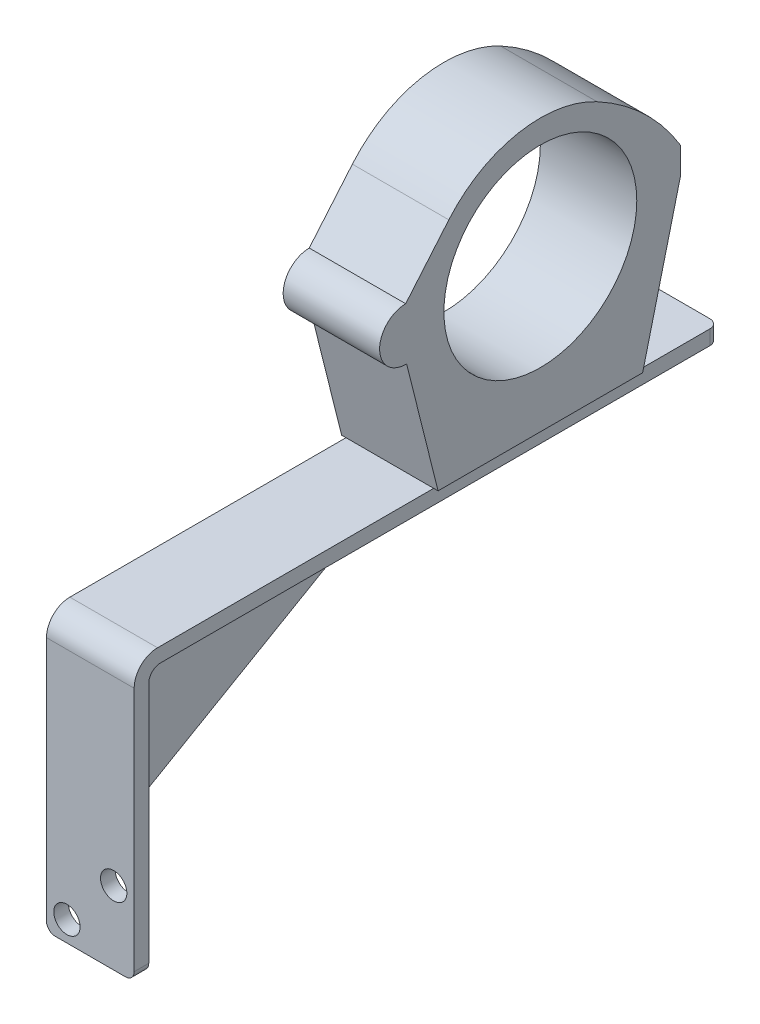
ISO-10303-21;
HEADER;
FILE_DESCRIPTION(('STEP AP214'),'2;1');
FILE_NAME('part.step','',(''),(''),'','','');
FILE_SCHEMA(('AUTOMOTIVE_DESIGN { 1 0 10303 214 1 1 1 1 }'));
ENDSEC;
DATA;
#1=APPLICATION_CONTEXT('core data for automotive mechanical design processes');
#2=APPLICATION_PROTOCOL_DEFINITION('international standard','automotive_design',2000,#1);
#3=PRODUCT_CONTEXT('',#1,'mechanical');
#4=PRODUCT('Part','Part','',(#3));
#5=PRODUCT_RELATED_PRODUCT_CATEGORY('part','',(#4));
#6=PRODUCT_DEFINITION_FORMATION('','',#4);
#7=PRODUCT_DEFINITION_CONTEXT('part definition',#1,'design');
#8=PRODUCT_DEFINITION('design','',#6,#7);
#9=PRODUCT_DEFINITION_SHAPE('','',#8);
#10=(LENGTH_UNIT() NAMED_UNIT(*) SI_UNIT(.MILLI.,.METRE.));
#11=(NAMED_UNIT(*) PLANE_ANGLE_UNIT() SI_UNIT($,.RADIAN.));
#12=(NAMED_UNIT(*) SI_UNIT($,.STERADIAN.) SOLID_ANGLE_UNIT());
#13=UNCERTAINTY_MEASURE_WITH_UNIT(LENGTH_MEASURE(1.E-05),#10,'distance_accuracy_value','');
#14=(GEOMETRIC_REPRESENTATION_CONTEXT(3) GLOBAL_UNCERTAINTY_ASSIGNED_CONTEXT((#13)) GLOBAL_UNIT_ASSIGNED_CONTEXT((#10,
#11,#12)) REPRESENTATION_CONTEXT('',''));
#15=CARTESIAN_POINT('',(0.,0.,0.));
#16=DIRECTION('',(0.,0.,1.));
#17=DIRECTION('',(1.,0.,0.));
#18=AXIS2_PLACEMENT_3D('',#15,#16,#17);
#19=CARTESIAN_POINT('',(-30.,5.,-200.));
#20=DIRECTION('',(0.,-1.,0.));
#21=DIRECTION('',(0.,0.,1.));
#22=AXIS2_PLACEMENT_3D('',#19,#20,#21);
#23=PLANE('',#22);
#24=DIRECTION('',(0.,0.,-1.));
#25=VECTOR('',#24,1.);
#26=CARTESIAN_POINT('',(-30.,5.,-200.));
#27=LINE('',#26,#25);
#28=CARTESIAN_POINT('',(-30.,5.,-172.478971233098));
#29=VERTEX_POINT('',#28);
#30=CARTESIAN_POINT('',(-30.,5.,-197.));
#31=VERTEX_POINT('',#30);
#32=EDGE_CURVE('E328',#29,#31,#27,.T.);
#33=ORIENTED_EDGE('',*,*,#32,.F.);
#34=DIRECTION('',(1.,0.,0.));
#35=VECTOR('',#34,1.);
#36=CARTESIAN_POINT('',(-30.,5.,-172.478971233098));
#37=LINE('',#36,#35);
#38=CARTESIAN_POINT('',(0.,5.,-172.478971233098));
#39=VERTEX_POINT('',#38);
#40=EDGE_CURVE('E11',#29,#39,#37,.T.);
#41=ORIENTED_EDGE('',*,*,#40,.T.);
#42=DIRECTION('',(0.,0.,-1.));
#43=VECTOR('',#42,1.);
#44=CARTESIAN_POINT('',(0.,5.,-200.));
#45=LINE('',#44,#43);
#46=CARTESIAN_POINT('',(0.,5.,-197.));
#47=VERTEX_POINT('',#46);
#48=EDGE_CURVE('E340',#39,#47,#45,.T.);
#49=ORIENTED_EDGE('',*,*,#48,.T.);
#50=CARTESIAN_POINT('',(-3.,5.,-197.));
#51=DIRECTION('',(0.,-1.,0.));
#52=DIRECTION('',(0.,0.,1.));
#53=AXIS2_PLACEMENT_3D('',#50,#51,#52);
#54=CIRCLE('',#53,3.);
#55=CARTESIAN_POINT('',(-3.,5.,-200.));
#56=VERTEX_POINT('',#55);
#57=EDGE_CURVE('E393',#47,#56,#54,.F.);
#58=ORIENTED_EDGE('',*,*,#57,.T.);
#59=DIRECTION('',(1.,0.,0.));
#60=VECTOR('',#59,1.);
#61=CARTESIAN_POINT('',(-30.,5.,-200.));
#62=LINE('',#61,#60);
#63=CARTESIAN_POINT('',(-27.,5.,-200.));
#64=VERTEX_POINT('',#63);
#65=EDGE_CURVE('E332',#64,#56,#62,.T.);
#66=ORIENTED_EDGE('',*,*,#65,.F.);
#67=CARTESIAN_POINT('',(-27.,5.,-197.));
#68=DIRECTION('',(0.,-1.,0.));
#69=DIRECTION('',(0.,0.,1.));
#70=AXIS2_PLACEMENT_3D('',#67,#68,#69);
#71=CIRCLE('',#70,3.);
#72=EDGE_CURVE('E390',#64,#31,#71,.F.);
#73=ORIENTED_EDGE('',*,*,#72,.T.);
#74=EDGE_LOOP('',(#33,#41,#49,#58,#66,#73));
#75=FACE_BOUND('',#74,.T.);
#76=ADVANCED_FACE('F17',(#75),#23,.F.);
#77=CARTESIAN_POINT('',(-17.5,-20.,-5.));
#78=DIRECTION('',(1.,0.,0.));
#79=DIRECTION('',(0.,0.,-1.));
#80=AXIS2_PLACEMENT_3D('',#77,#78,#79);
#81=PLANE('',#80);
#82=DIRECTION('',(0.,0.5,-0.86602540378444));
#83=VECTOR('',#82,1.);
#84=CARTESIAN_POINT('',(-17.5,0.,-39.6410161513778));
#85=LINE('',#84,#83);
#86=CARTESIAN_POINT('',(-17.5,-20.,-5.));
#87=VERTEX_POINT('',#86);
#88=CARTESIAN_POINT('',(-17.5,0.,-39.6410161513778));
#89=VERTEX_POINT('',#88);
#90=EDGE_CURVE('E262',#87,#89,#85,.T.);
#91=ORIENTED_EDGE('',*,*,#90,.T.);
#92=DIRECTION('',(0.,0.,-1.));
#93=VECTOR('',#92,1.);
#94=CARTESIAN_POINT('',(-17.5,0.,-99.6410161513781));
#95=LINE('',#94,#93);
#96=CARTESIAN_POINT('',(-17.5,0.,-99.6410161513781));
#97=VERTEX_POINT('',#96);
#98=EDGE_CURVE('E278',#89,#97,#95,.T.);
#99=ORIENTED_EDGE('',*,*,#98,.T.);
#100=DIRECTION('',(0.,-0.5,0.86602540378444));
#101=VECTOR('',#100,1.);
#102=CARTESIAN_POINT('',(-17.5,0.,-99.6410161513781));
#103=LINE('',#102,#101);
#104=CARTESIAN_POINT('',(-17.5,-54.6410161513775,-5.));
#105=VERTEX_POINT('',#104);
#106=EDGE_CURVE('E281',#97,#105,#103,.T.);
#107=ORIENTED_EDGE('',*,*,#106,.T.);
#108=DIRECTION('',(0.,1.,0.));
#109=VECTOR('',#108,1.);
#110=CARTESIAN_POINT('',(-17.5,-20.,-5.));
#111=LINE('',#110,#109);
#112=EDGE_CURVE('E284',#105,#87,#111,.T.);
#113=ORIENTED_EDGE('',*,*,#112,.T.);
#114=EDGE_LOOP('',(#91,#99,#107,#113));
#115=FACE_BOUND('',#114,.T.);
#116=ADVANCED_FACE('F487',(#115),#81,.F.);
#117=CARTESIAN_POINT('',(-12.5,0.,-99.6410161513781));
#118=DIRECTION('',(0.,-0.86602540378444,-0.5));
#119=DIRECTION('',(0.,-0.5,0.86602540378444));
#120=AXIS2_PLACEMENT_3D('',#117,#118,#119);
#121=PLANE('',#120);
#122=DIRECTION('',(-1.,0.,0.));
#123=VECTOR('',#122,1.);
#124=CARTESIAN_POINT('',(-12.5,-54.6410161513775,-5.));
#125=LINE('',#124,#123);
#126=CARTESIAN_POINT('',(-12.5,-54.6410161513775,-5.));
#127=VERTEX_POINT('',#126);
#128=EDGE_CURVE('E301',#127,#105,#125,.T.);
#129=ORIENTED_EDGE('',*,*,#128,.T.);
#130=ORIENTED_EDGE('',*,*,#106,.F.);
#131=DIRECTION('',(-1.,0.,0.));
#132=VECTOR('',#131,1.);
#133=CARTESIAN_POINT('',(-12.5,0.,-99.6410161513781));
#134=LINE('',#133,#132);
#135=CARTESIAN_POINT('',(-12.5,0.,-99.641016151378));
#136=VERTEX_POINT('',#135);
#137=EDGE_CURVE('E304',#136,#97,#134,.T.);
#138=ORIENTED_EDGE('',*,*,#137,.F.);
#139=DIRECTION('',(0.,-0.5,0.86602540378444));
#140=VECTOR('',#139,1.);
#141=CARTESIAN_POINT('',(-12.5,0.,-99.6410161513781));
#142=LINE('',#141,#140);
#143=EDGE_CURVE('E292',#136,#127,#142,.T.);
#144=ORIENTED_EDGE('',*,*,#143,.T.);
#145=EDGE_LOOP('',(#129,#130,#138,#144));
#146=FACE_BOUND('',#145,.T.);
#147=ADVANCED_FACE('F492',(#146),#121,.T.);
#148=CARTESIAN_POINT('',(-12.5,-20.,-5.));
#149=DIRECTION('',(1.,0.,0.));
#150=DIRECTION('',(0.,0.,-1.));
#151=AXIS2_PLACEMENT_3D('',#148,#149,#150);
#152=PLANE('',#151);
#153=DIRECTION('',(0.,0.5,-0.86602540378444));
#154=VECTOR('',#153,1.);
#155=CARTESIAN_POINT('',(-12.5,0.,-39.6410161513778));
#156=LINE('',#155,#154);
#157=CARTESIAN_POINT('',(-12.5,-20.,-5.));
#158=VERTEX_POINT('',#157);
#159=CARTESIAN_POINT('',(-12.5,0.,-39.6410161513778));
#160=VERTEX_POINT('',#159);
#161=EDGE_CURVE('E287',#158,#160,#156,.T.);
#162=ORIENTED_EDGE('',*,*,#161,.F.);
#163=DIRECTION('',(0.,1.,0.));
#164=VECTOR('',#163,1.);
#165=CARTESIAN_POINT('',(-12.5,-20.,-5.));
#166=LINE('',#165,#164);
#167=EDGE_CURVE('E295',#127,#158,#166,.T.);
#168=ORIENTED_EDGE('',*,*,#167,.F.);
#169=ORIENTED_EDGE('',*,*,#143,.F.);
#170=DIRECTION('',(0.,0.,-1.));
#171=VECTOR('',#170,1.);
#172=CARTESIAN_POINT('',(-12.5,0.,-99.6410161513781));
#173=LINE('',#172,#171);
#174=EDGE_CURVE('E290',#160,#136,#173,.T.);
#175=ORIENTED_EDGE('',*,*,#174,.F.);
#176=EDGE_LOOP('',(#162,#168,#169,#175));
#177=FACE_BOUND('',#176,.T.);
#178=ADVANCED_FACE('F520',(#177),#152,.T.);
#179=CARTESIAN_POINT('',(-12.5,0.,-39.6410161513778));
#180=DIRECTION('',(0.,0.86602540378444,0.5));
#181=DIRECTION('',(0.,0.5,-0.86602540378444));
#182=AXIS2_PLACEMENT_3D('',#179,#180,#181);
#183=PLANE('',#182);
#184=DIRECTION('',(-1.,0.,0.));
#185=VECTOR('',#184,1.);
#186=CARTESIAN_POINT('',(-12.5,0.,-39.6410161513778));
#187=LINE('',#186,#185);
#188=EDGE_CURVE('E297',#160,#89,#187,.T.);
#189=ORIENTED_EDGE('',*,*,#188,.T.);
#190=ORIENTED_EDGE('',*,*,#90,.F.);
#191=DIRECTION('',(-1.,0.,0.));
#192=VECTOR('',#191,1.);
#193=CARTESIAN_POINT('',(-12.5,-20.,-5.));
#194=LINE('',#193,#192);
#195=EDGE_CURVE('E298',#158,#87,#194,.T.);
#196=ORIENTED_EDGE('',*,*,#195,.F.);
#197=ORIENTED_EDGE('',*,*,#161,.T.);
#198=EDGE_LOOP('',(#189,#190,#196,#197));
#199=FACE_BOUND('',#198,.T.);
#200=ADVANCED_FACE('F517',(#199),#183,.T.);
#201=CARTESIAN_POINT('',(-30.,5.,-200.));
#202=DIRECTION('',(0.,0.,1.));
#203=DIRECTION('',(1.,0.,0.));
#204=AXIS2_PLACEMENT_3D('',#201,#202,#203);
#205=PLANE('',#204);
#206=ORIENTED_EDGE('',*,*,#65,.T.);
#207=DIRECTION('',(0.,-1.,0.));
#208=VECTOR('',#207,1.);
#209=CARTESIAN_POINT('',(-3.,5.,-200.));
#210=LINE('',#209,#208);
#211=CARTESIAN_POINT('',(-3.,0.,-200.));
#212=VERTEX_POINT('',#211);
#213=EDGE_CURVE('E383',#56,#212,#210,.T.);
#214=ORIENTED_EDGE('',*,*,#213,.T.);
#215=DIRECTION('',(1.,0.,0.));
#216=VECTOR('',#215,1.);
#217=CARTESIAN_POINT('',(-30.,0.,-200.));
#218=LINE('',#217,#216);
#219=CARTESIAN_POINT('',(-27.,0.,-200.));
#220=VERTEX_POINT('',#219);
#221=EDGE_CURVE('E352',#220,#212,#218,.T.);
#222=ORIENTED_EDGE('',*,*,#221,.F.);
#223=DIRECTION('',(0.,-1.,0.));
#224=VECTOR('',#223,1.);
#225=CARTESIAN_POINT('',(-27.,5.,-200.));
#226=LINE('',#225,#224);
#227=EDGE_CURVE('E381',#220,#64,#226,.F.);
#228=ORIENTED_EDGE('',*,*,#227,.T.);
#229=EDGE_LOOP('',(#206,#214,#222,#228));
#230=FACE_BOUND('',#229,.T.);
#231=ADVANCED_FACE('F441',(#230),#205,.F.);
#232=CARTESIAN_POINT('',(-30.,-90.,-5.));
#233=DIRECTION('',(0.,1.,0.));
#234=DIRECTION('',(0.,0.,-1.));
#235=AXIS2_PLACEMENT_3D('',#232,#233,#234);
#236=PLANE('',#235);
#237=DIRECTION('',(1.,0.,0.));
#238=VECTOR('',#237,1.);
#239=CARTESIAN_POINT('',(-30.,-90.,-5.));
#240=LINE('',#239,#238);
#241=CARTESIAN_POINT('',(-27.,-90.,-5.));
#242=VERTEX_POINT('',#241);
#243=CARTESIAN_POINT('',(-3.,-90.,-5.));
#244=VERTEX_POINT('',#243);
#245=EDGE_CURVE('E349',#242,#244,#240,.T.);
#246=ORIENTED_EDGE('',*,*,#245,.T.);
#247=DIRECTION('',(0.,0.,1.));
#248=VECTOR('',#247,1.);
#249=CARTESIAN_POINT('',(-3.,-90.,-5.));
#250=LINE('',#249,#248);
#251=CARTESIAN_POINT('',(-3.,-90.,0.));
#252=VERTEX_POINT('',#251);
#253=EDGE_CURVE('E357',#244,#252,#250,.T.);
#254=ORIENTED_EDGE('',*,*,#253,.T.);
#255=DIRECTION('',(1.,0.,0.));
#256=VECTOR('',#255,1.);
#257=CARTESIAN_POINT('',(-30.,-90.,0.));
#258=LINE('',#257,#256);
#259=CARTESIAN_POINT('',(-27.,-90.,0.));
#260=VERTEX_POINT('',#259);
#261=EDGE_CURVE('E346',#260,#252,#258,.T.);
#262=ORIENTED_EDGE('',*,*,#261,.F.);
#263=DIRECTION('',(0.,0.,1.));
#264=VECTOR('',#263,1.);
#265=CARTESIAN_POINT('',(-27.,-90.,-5.));
#266=LINE('',#265,#264);
#267=EDGE_CURVE('E355',#260,#242,#266,.F.);
#268=ORIENTED_EDGE('',*,*,#267,.T.);
#269=EDGE_LOOP('',(#246,#254,#262,#268));
#270=FACE_BOUND('',#269,.T.);
#271=ADVANCED_FACE('F466',(#270),#236,.F.);
#272=CARTESIAN_POINT('',(-23.,-83.,-5.));
#273=DIRECTION('',(0.,0.,-1.));
#274=DIRECTION('',(-1.,0.,0.));
#275=AXIS2_PLACEMENT_3D('',#272,#273,#274);
#276=CYLINDRICAL_SURFACE('',#275,4.5);
#277=CARTESIAN_POINT('',(-23.,-83.,0.));
#278=DIRECTION('',(0.,0.,-1.));
#279=DIRECTION('',(-1.,0.,0.));
#280=AXIS2_PLACEMENT_3D('',#277,#278,#279);
#281=CIRCLE('',#280,4.5);
#282=CARTESIAN_POINT('',(-27.5,-83.,0.));
#283=VERTEX_POINT('',#282);
#284=EDGE_CURVE('E313',#283,#283,#281,.T.);
#285=ORIENTED_EDGE('',*,*,#284,.F.);
#286=EDGE_LOOP('',(#285));
#287=FACE_BOUND('',#286,.T.);
#288=CARTESIAN_POINT('',(-23.,-83.,-5.));
#289=DIRECTION('',(0.,0.,-1.));
#290=DIRECTION('',(-1.,0.,0.));
#291=AXIS2_PLACEMENT_3D('',#288,#289,#290);
#292=CIRCLE('',#291,4.5);
#293=CARTESIAN_POINT('',(-27.5,-83.,-5.));
#294=VERTEX_POINT('',#293);
#295=EDGE_CURVE('E316',#294,#294,#292,.T.);
#296=ORIENTED_EDGE('',*,*,#295,.T.);
#297=EDGE_LOOP('',(#296));
#298=FACE_BOUND('',#297,.T.);
#299=ADVANCED_FACE('F509',(#287,#298),#276,.F.);
#300=CARTESIAN_POINT('',(-7.,-65.,-5.));
#301=DIRECTION('',(0.,0.,-1.));
#302=DIRECTION('',(-1.,0.,0.));
#303=AXIS2_PLACEMENT_3D('',#300,#301,#302);
#304=CYLINDRICAL_SURFACE('',#303,4.5);
#305=CARTESIAN_POINT('',(-7.,-65.,0.));
#306=DIRECTION('',(0.,0.,-1.));
#307=DIRECTION('',(-1.,0.,0.));
#308=AXIS2_PLACEMENT_3D('',#305,#306,#307);
#309=CIRCLE('',#308,4.5);
#310=CARTESIAN_POINT('',(-11.5,-65.,0.));
#311=VERTEX_POINT('',#310);
#312=EDGE_CURVE('E300',#311,#311,#309,.T.);
#313=ORIENTED_EDGE('',*,*,#312,.F.);
#314=EDGE_LOOP('',(#313));
#315=FACE_BOUND('',#314,.T.);
#316=CARTESIAN_POINT('',(-7.,-65.,-5.));
#317=DIRECTION('',(0.,0.,-1.));
#318=DIRECTION('',(-1.,0.,0.));
#319=AXIS2_PLACEMENT_3D('',#316,#317,#318);
#320=CIRCLE('',#319,4.5);
#321=CARTESIAN_POINT('',(-11.5,-65.,-5.));
#322=VERTEX_POINT('',#321);
#323=EDGE_CURVE('E310',#322,#322,#320,.T.);
#324=ORIENTED_EDGE('',*,*,#323,.T.);
#325=EDGE_LOOP('',(#324));
#326=FACE_BOUND('',#325,.T.);
#327=ADVANCED_FACE('F512',(#315,#326),#304,.F.);
#328=CARTESIAN_POINT('',(-3.,5.,-197.));
#329=DIRECTION('',(0.,-1.,0.));
#330=DIRECTION('',(0.,0.,1.));
#331=AXIS2_PLACEMENT_3D('',#328,#329,#330);
#332=CYLINDRICAL_SURFACE('',#331,3.);
#333=ORIENTED_EDGE('',*,*,#57,.F.);
#334=DIRECTION('',(0.,-1.,0.));
#335=VECTOR('',#334,1.);
#336=CARTESIAN_POINT('',(0.,0.,-197.));
#337=LINE('',#336,#335);
#338=CARTESIAN_POINT('',(0.,0.,-197.));
#339=VERTEX_POINT('',#338);
#340=EDGE_CURVE('E364',#339,#47,#337,.F.);
#341=ORIENTED_EDGE('',*,*,#340,.F.);
#342=CARTESIAN_POINT('',(-3.,0.,-197.));
#343=DIRECTION('',(0.,1.,0.));
#344=DIRECTION('',(0.,0.,-1.));
#345=AXIS2_PLACEMENT_3D('',#342,#343,#344);
#346=CIRCLE('',#345,3.);
#347=EDGE_CURVE('E388',#212,#339,#346,.F.);
#348=ORIENTED_EDGE('',*,*,#347,.F.);
#349=ORIENTED_EDGE('',*,*,#213,.F.);
#350=EDGE_LOOP('',(#333,#341,#348,#349));
#351=FACE_BOUND('',#350,.T.);
#352=ADVANCED_FACE('F438',(#351),#332,.T.);
#353=CARTESIAN_POINT('',(-3.,-87.,-5.));
#354=DIRECTION('',(0.,0.,1.));
#355=DIRECTION('',(1.,0.,0.));
#356=AXIS2_PLACEMENT_3D('',#353,#354,#355);
#357=CYLINDRICAL_SURFACE('',#356,3.);
#358=CARTESIAN_POINT('',(-3.,-87.,-5.));
#359=DIRECTION('',(0.,0.,1.));
#360=DIRECTION('',(0.,1.,0.));
#361=AXIS2_PLACEMENT_3D('',#358,#359,#360);
#362=CIRCLE('',#361,3.);
#363=CARTESIAN_POINT('',(0.,-87.,-5.));
#364=VERTEX_POINT('',#363);
#365=EDGE_CURVE('E373',#364,#244,#362,.F.);
#366=ORIENTED_EDGE('',*,*,#365,.F.);
#367=DIRECTION('',(0.,0.,1.));
#368=VECTOR('',#367,1.);
#369=CARTESIAN_POINT('',(0.,-87.,-200.));
#370=LINE('',#369,#368);
#371=CARTESIAN_POINT('',(0.,-87.,0.));
#372=VERTEX_POINT('',#371);
#373=EDGE_CURVE('E367',#372,#364,#370,.F.);
#374=ORIENTED_EDGE('',*,*,#373,.F.);
#375=CARTESIAN_POINT('',(-3.,-87.,0.));
#376=DIRECTION('',(0.,0.,-1.));
#377=DIRECTION('',(0.,-1.,0.));
#378=AXIS2_PLACEMENT_3D('',#375,#376,#377);
#379=CIRCLE('',#378,3.);
#380=EDGE_CURVE('E362',#252,#372,#379,.F.);
#381=ORIENTED_EDGE('',*,*,#380,.F.);
#382=ORIENTED_EDGE('',*,*,#253,.F.);
#383=EDGE_LOOP('',(#366,#374,#381,#382));
#384=FACE_BOUND('',#383,.T.);
#385=ADVANCED_FACE('F462',(#384),#357,.T.);
#386=CARTESIAN_POINT('',(-27.,-87.,-200.));
#387=DIRECTION('',(0.,0.,-1.));
#388=DIRECTION('',(-1.,0.,0.));
#389=AXIS2_PLACEMENT_3D('',#386,#387,#388);
#390=CYLINDRICAL_SURFACE('',#389,3.);
#391=CARTESIAN_POINT('',(-27.,-87.,-5.));
#392=DIRECTION('',(0.,0.,1.));
#393=DIRECTION('',(0.,1.,0.));
#394=AXIS2_PLACEMENT_3D('',#391,#392,#393);
#395=CIRCLE('',#394,3.);
#396=CARTESIAN_POINT('',(-30.,-87.,-5.));
#397=VERTEX_POINT('',#396);
#398=EDGE_CURVE('E370',#242,#397,#395,.F.);
#399=ORIENTED_EDGE('',*,*,#398,.F.);
#400=ORIENTED_EDGE('',*,*,#267,.F.);
#401=CARTESIAN_POINT('',(-27.,-87.,0.));
#402=DIRECTION('',(0.,0.,-1.));
#403=DIRECTION('',(0.,-1.,0.));
#404=AXIS2_PLACEMENT_3D('',#401,#402,#403);
#405=CIRCLE('',#404,3.);
#406=CARTESIAN_POINT('',(-30.,-87.,0.));
#407=VERTEX_POINT('',#406);
#408=EDGE_CURVE('E360',#407,#260,#405,.F.);
#409=ORIENTED_EDGE('',*,*,#408,.F.);
#410=DIRECTION('',(0.,0.,1.));
#411=VECTOR('',#410,1.);
#412=CARTESIAN_POINT('',(-30.,-87.,0.));
#413=LINE('',#412,#411);
#414=EDGE_CURVE('E378',#397,#407,#413,.T.);
#415=ORIENTED_EDGE('',*,*,#414,.F.);
#416=EDGE_LOOP('',(#399,#400,#409,#415));
#417=FACE_BOUND('',#416,.T.);
#418=ADVANCED_FACE('F470',(#417),#390,.T.);
#419=CARTESIAN_POINT('',(-30.,0.,-5.));
#420=DIRECTION('',(0.,0.,1.));
#421=DIRECTION('',(0.,1.,0.));
#422=AXIS2_PLACEMENT_3D('',#419,#420,#421);
#423=PLANE('',#422);
#424=ORIENTED_EDGE('',*,*,#128,.F.);
#425=ORIENTED_EDGE('',*,*,#167,.T.);
#426=ORIENTED_EDGE('',*,*,#195,.T.);
#427=ORIENTED_EDGE('',*,*,#112,.F.);
#428=EDGE_LOOP('',(#424,#425,#426,#427));
#429=FACE_BOUND('',#428,.T.);
#430=ORIENTED_EDGE('',*,*,#323,.F.);
#431=EDGE_LOOP('',(#430));
#432=FACE_BOUND('',#431,.T.);
#433=ORIENTED_EDGE('',*,*,#295,.F.);
#434=EDGE_LOOP('',(#433));
#435=FACE_BOUND('',#434,.T.);
#436=DIRECTION('',(0.,-1.,0.));
#437=VECTOR('',#436,1.);
#438=CARTESIAN_POINT('',(-30.,0.,-5.));
#439=LINE('',#438,#437);
#440=CARTESIAN_POINT('',(-30.,-4.,-5.));
#441=VERTEX_POINT('',#440);
#442=EDGE_CURVE('E323',#441,#397,#439,.T.);
#443=ORIENTED_EDGE('',*,*,#442,.F.);
#444=DIRECTION('',(1.,0.,0.));
#445=VECTOR('',#444,1.);
#446=CARTESIAN_POINT('',(0.,-4.,-5.));
#447=LINE('',#446,#445);
#448=CARTESIAN_POINT('',(0.,-4.,-5.));
#449=VERTEX_POINT('',#448);
#450=EDGE_CURVE('E395',#441,#449,#447,.T.);
#451=ORIENTED_EDGE('',*,*,#450,.T.);
#452=DIRECTION('',(0.,-1.,0.));
#453=VECTOR('',#452,1.);
#454=CARTESIAN_POINT('',(0.,0.,-5.));
#455=LINE('',#454,#453);
#456=EDGE_CURVE('E336',#449,#364,#455,.T.);
#457=ORIENTED_EDGE('',*,*,#456,.T.);
#458=ORIENTED_EDGE('',*,*,#365,.T.);
#459=ORIENTED_EDGE('',*,*,#245,.F.);
#460=ORIENTED_EDGE('',*,*,#398,.T.);
#461=EDGE_LOOP('',(#443,#451,#457,#458,#459,#460));
#462=FACE_BOUND('',#461,.T.);
#463=ADVANCED_FACE('F457',(#429,#432,#435,#462),#423,.F.);
#464=CARTESIAN_POINT('',(-30.,-4.,-9.));
#465=DIRECTION('',(-1.,0.,0.));
#466=DIRECTION('',(0.,0.,1.));
#467=AXIS2_PLACEMENT_3D('',#464,#465,#466);
#468=CYLINDRICAL_SURFACE('',#467,4.);
#469=CARTESIAN_POINT('',(-30.,-4.,-9.));
#470=DIRECTION('',(-1.,0.,0.));
#471=DIRECTION('',(0.,0.,1.));
#472=AXIS2_PLACEMENT_3D('',#469,#470,#471);
#473=CIRCLE('',#472,4.);
#474=CARTESIAN_POINT('',(-30.,0.,-9.));
#475=VERTEX_POINT('',#474);
#476=EDGE_CURVE('E402',#475,#441,#473,.F.);
#477=ORIENTED_EDGE('',*,*,#476,.F.);
#478=DIRECTION('',(1.,0.,0.));
#479=VECTOR('',#478,1.);
#480=CARTESIAN_POINT('',(-30.,0.,-9.));
#481=LINE('',#480,#479);
#482=CARTESIAN_POINT('',(0.,0.,-9.));
#483=VERTEX_POINT('',#482);
#484=EDGE_CURVE('E398',#483,#475,#481,.F.);
#485=ORIENTED_EDGE('',*,*,#484,.F.);
#486=CARTESIAN_POINT('',(0.,-4.,-9.));
#487=DIRECTION('',(-1.,0.,0.));
#488=DIRECTION('',(0.,0.,1.));
#489=AXIS2_PLACEMENT_3D('',#486,#487,#488);
#490=CIRCLE('',#489,4.);
#491=EDGE_CURVE('E400',#449,#483,#490,.T.);
#492=ORIENTED_EDGE('',*,*,#491,.F.);
#493=ORIENTED_EDGE('',*,*,#450,.F.);
#494=EDGE_LOOP('',(#477,#485,#492,#493));
#495=FACE_BOUND('',#494,.T.);
#496=ADVANCED_FACE('F454',(#495),#468,.F.);
#497=CARTESIAN_POINT('',(-14.999999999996,0.,-153.739485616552));
#498=DIRECTION('',(0.,-1.,0.));
#499=DIRECTION('',(0.,0.,-1.));
#500=AXIS2_PLACEMENT_3D('',#497,#498,#499);
#501=PLANE('',#500);
#502=ORIENTED_EDGE('',*,*,#188,.F.);
#503=ORIENTED_EDGE('',*,*,#174,.T.);
#504=ORIENTED_EDGE('',*,*,#137,.T.);
#505=ORIENTED_EDGE('',*,*,#98,.F.);
#506=EDGE_LOOP('',(#502,#503,#504,#505));
#507=FACE_BOUND('',#506,.T.);
#508=DIRECTION('',(0.,0.,1.));
#509=VECTOR('',#508,1.);
#510=CARTESIAN_POINT('',(0.,0.,-200.));
#511=LINE('',#510,#509);
#512=EDGE_CURVE('E319',#339,#483,#511,.T.);
#513=ORIENTED_EDGE('',*,*,#512,.T.);
#514=ORIENTED_EDGE('',*,*,#484,.T.);
#515=DIRECTION('',(0.,0.,1.));
#516=VECTOR('',#515,1.);
#517=CARTESIAN_POINT('',(-30.,0.,-200.));
#518=LINE('',#517,#516);
#519=CARTESIAN_POINT('',(-30.,0.,-197.));
#520=VERTEX_POINT('',#519);
#521=EDGE_CURVE('E320',#520,#475,#518,.T.);
#522=ORIENTED_EDGE('',*,*,#521,.F.);
#523=CARTESIAN_POINT('',(-27.,0.,-197.));
#524=DIRECTION('',(0.,1.,0.));
#525=DIRECTION('',(0.,0.,-1.));
#526=AXIS2_PLACEMENT_3D('',#523,#524,#525);
#527=CIRCLE('',#526,3.);
#528=EDGE_CURVE('E386',#520,#220,#527,.F.);
#529=ORIENTED_EDGE('',*,*,#528,.T.);
#530=ORIENTED_EDGE('',*,*,#221,.T.);
#531=ORIENTED_EDGE('',*,*,#347,.T.);
#532=EDGE_LOOP('',(#513,#514,#522,#529,#530,#531));
#533=FACE_BOUND('',#532,.T.);
#534=ADVANCED_FACE('F19',(#507,#533),#501,.T.);
#535=CARTESIAN_POINT('',(-27.,0.,-197.));
#536=DIRECTION('',(0.,1.,0.));
#537=DIRECTION('',(0.,0.,-1.));
#538=AXIS2_PLACEMENT_3D('',#535,#536,#537);
#539=CYLINDRICAL_SURFACE('',#538,3.);
#540=ORIENTED_EDGE('',*,*,#72,.F.);
#541=ORIENTED_EDGE('',*,*,#227,.F.);
#542=ORIENTED_EDGE('',*,*,#528,.F.);
#543=DIRECTION('',(0.,-1.,0.));
#544=VECTOR('',#543,1.);
#545=CARTESIAN_POINT('',(-30.,0.,-197.));
#546=LINE('',#545,#544);
#547=EDGE_CURVE('E375',#31,#520,#546,.T.);
#548=ORIENTED_EDGE('',*,*,#547,.F.);
#549=EDGE_LOOP('',(#540,#541,#542,#548));
#550=FACE_BOUND('',#549,.T.);
#551=ADVANCED_FACE('F448',(#550),#539,.T.);
#552=CARTESIAN_POINT('',(-30.,-3.,-8.));
#553=DIRECTION('',(1.,0.,0.));
#554=DIRECTION('',(0.,0.,-1.));
#555=AXIS2_PLACEMENT_3D('',#552,#553,#554);
#556=CYLINDRICAL_SURFACE('',#555,8.);
#557=CARTESIAN_POINT('',(-30.,-3.,-8.));
#558=DIRECTION('',(-1.,0.,0.));
#559=DIRECTION('',(0.,0.,1.));
#560=AXIS2_PLACEMENT_3D('',#557,#558,#559);
#561=CIRCLE('',#560,8.);
#562=CARTESIAN_POINT('',(-30.,-3.,0.));
#563=VERTEX_POINT('',#562);
#564=CARTESIAN_POINT('',(-30.,5.,-8.));
#565=VERTEX_POINT('',#564);
#566=EDGE_CURVE('E410',#563,#565,#561,.T.);
#567=ORIENTED_EDGE('',*,*,#566,.F.);
#568=DIRECTION('',(1.,0.,0.));
#569=VECTOR('',#568,1.);
#570=CARTESIAN_POINT('',(-30.,-3.,0.));
#571=LINE('',#570,#569);
#572=CARTESIAN_POINT('',(0.,-3.,0.));
#573=VERTEX_POINT('',#572);
#574=EDGE_CURVE('E40',#573,#563,#571,.F.);
#575=ORIENTED_EDGE('',*,*,#574,.F.);
#576=CARTESIAN_POINT('',(0.,-3.,-8.));
#577=DIRECTION('',(-1.,0.,0.));
#578=DIRECTION('',(0.,0.,1.));
#579=AXIS2_PLACEMENT_3D('',#576,#577,#578);
#580=CIRCLE('',#579,8.);
#581=CARTESIAN_POINT('',(0.,5.,-8.));
#582=VERTEX_POINT('',#581);
#583=EDGE_CURVE('E407',#582,#573,#580,.F.);
#584=ORIENTED_EDGE('',*,*,#583,.F.);
#585=DIRECTION('',(1.,0.,0.));
#586=VECTOR('',#585,1.);
#587=CARTESIAN_POINT('',(-30.,5.,-8.));
#588=LINE('',#587,#586);
#589=EDGE_CURVE('E404',#565,#582,#588,.T.);
#590=ORIENTED_EDGE('',*,*,#589,.F.);
#591=EDGE_LOOP('',(#567,#575,#584,#590));
#592=FACE_BOUND('',#591,.T.);
#593=ADVANCED_FACE('F423',(#592),#556,.T.);
#594=CARTESIAN_POINT('',(-30.,5.,0.));
#595=DIRECTION('',(0.,0.,-1.));
#596=DIRECTION('',(0.,-1.,0.));
#597=AXIS2_PLACEMENT_3D('',#594,#595,#596);
#598=PLANE('',#597);
#599=ORIENTED_EDGE('',*,*,#312,.T.);
#600=EDGE_LOOP('',(#599));
#601=FACE_BOUND('',#600,.T.);
#602=ORIENTED_EDGE('',*,*,#284,.T.);
#603=EDGE_LOOP('',(#602));
#604=FACE_BOUND('',#603,.T.);
#605=DIRECTION('',(0.,1.,0.));
#606=VECTOR('',#605,1.);
#607=CARTESIAN_POINT('',(0.,5.,0.));
#608=LINE('',#607,#606);
#609=EDGE_CURVE('E338',#372,#573,#608,.T.);
#610=ORIENTED_EDGE('',*,*,#609,.T.);
#611=ORIENTED_EDGE('',*,*,#574,.T.);
#612=DIRECTION('',(0.,1.,0.));
#613=VECTOR('',#612,1.);
#614=CARTESIAN_POINT('',(-30.,5.,0.));
#615=LINE('',#614,#613);
#616=EDGE_CURVE('E326',#407,#563,#615,.T.);
#617=ORIENTED_EDGE('',*,*,#616,.F.);
#618=ORIENTED_EDGE('',*,*,#408,.T.);
#619=ORIENTED_EDGE('',*,*,#261,.T.);
#620=ORIENTED_EDGE('',*,*,#380,.T.);
#621=EDGE_LOOP('',(#610,#611,#617,#618,#619,#620));
#622=FACE_BOUND('',#621,.T.);
#623=ADVANCED_FACE('F472',(#601,#604,#622),#598,.F.);
#624=CARTESIAN_POINT('',(-30.,0.,-200.));
#625=DIRECTION('',(-1.,0.,0.));
#626=DIRECTION('',(0.,0.,1.));
#627=AXIS2_PLACEMENT_3D('',#624,#625,#626);
#628=PLANE('',#627);
#629=ORIENTED_EDGE('',*,*,#616,.T.);
#630=ORIENTED_EDGE('',*,*,#566,.T.);
#631=CARTESIAN_POINT('',(-30.,5.,-102.482346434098));
#632=VERTEX_POINT('',#631);
#633=EDGE_CURVE('E329',#565,#632,#27,.T.);
#634=ORIENTED_EDGE('',*,*,#633,.T.);
#635=EDGE_CURVE('E333',#632,#29,#27,.T.);
#636=ORIENTED_EDGE('',*,*,#635,.T.);
#637=ORIENTED_EDGE('',*,*,#32,.T.);
#638=ORIENTED_EDGE('',*,*,#547,.T.);
#639=ORIENTED_EDGE('',*,*,#521,.T.);
#640=ORIENTED_EDGE('',*,*,#476,.T.);
#641=ORIENTED_EDGE('',*,*,#442,.T.);
#642=ORIENTED_EDGE('',*,*,#414,.T.);
#643=EDGE_LOOP('',(#629,#630,#634,#636,#637,#638,#639,#640,#641,#642));
#644=FACE_BOUND('',#643,.T.);
#645=ADVANCED_FACE('F420',(#644),#628,.T.);
#646=CARTESIAN_POINT('',(0.,0.,-200.));
#647=DIRECTION('',(-1.,0.,0.));
#648=DIRECTION('',(0.,0.,1.));
#649=AXIS2_PLACEMENT_3D('',#646,#647,#648);
#650=PLANE('',#649);
#651=CARTESIAN_POINT('',(0.,5.,-102.482346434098));
#652=VERTEX_POINT('',#651);
#653=EDGE_CURVE('E324',#582,#652,#45,.T.);
#654=ORIENTED_EDGE('',*,*,#653,.F.);
#655=ORIENTED_EDGE('',*,*,#583,.T.);
#656=ORIENTED_EDGE('',*,*,#609,.F.);
#657=ORIENTED_EDGE('',*,*,#373,.T.);
#658=ORIENTED_EDGE('',*,*,#456,.F.);
#659=ORIENTED_EDGE('',*,*,#491,.T.);
#660=ORIENTED_EDGE('',*,*,#512,.F.);
#661=ORIENTED_EDGE('',*,*,#340,.T.);
#662=ORIENTED_EDGE('',*,*,#48,.F.);
#663=EDGE_CURVE('E343',#652,#39,#45,.T.);
#664=ORIENTED_EDGE('',*,*,#663,.F.);
#665=EDGE_LOOP('',(#654,#655,#656,#657,#658,#659,#660,#661,#662,#664));
#666=FACE_BOUND('',#665,.T.);
#667=ADVANCED_FACE('F425',(#666),#650,.F.);
#668=ORIENTED_EDGE('',*,*,#653,.T.);
#669=DIRECTION('',(-1.,0.,0.));
#670=VECTOR('',#669,1.);
#671=CARTESIAN_POINT('',(-30.,5.,-102.482346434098));
#672=LINE('',#671,#670);
#673=EDGE_CURVE('E25',#652,#632,#672,.T.);
#674=ORIENTED_EDGE('',*,*,#673,.T.);
#675=ORIENTED_EDGE('',*,*,#633,.F.);
#676=ORIENTED_EDGE('',*,*,#589,.T.);
#677=EDGE_LOOP('',(#668,#674,#675,#676));
#678=FACE_BOUND('',#677,.T.);
#679=ADVANCED_FACE('F414',(#678),#23,.F.);
#680=CARTESIAN_POINT('',(-31.5,5.,-172.478971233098));
#681=DIRECTION('',(0.,-1.,0.));
#682=DIRECTION('',(1.,0.,0.));
#683=AXIS2_PLACEMENT_3D('',#680,#681,#682);
#684=PLANE('',#683);
#685=ORIENTED_EDGE('',*,*,#663,.T.);
#686=DIRECTION('',(1.,0.,0.));
#687=VECTOR('',#686,1.);
#688=CARTESIAN_POINT('',(-31.5,5.,-172.478971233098));
#689=LINE('',#688,#687);
#690=CARTESIAN_POINT('',(1.5,5.,-172.478971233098));
#691=VERTEX_POINT('',#690);
#692=EDGE_CURVE('E268',#39,#691,#689,.T.);
#693=ORIENTED_EDGE('',*,*,#692,.T.);
#694=DIRECTION('',(0.,0.,-1.));
#695=VECTOR('',#694,1.);
#696=CARTESIAN_POINT('',(1.5,5.,-172.478971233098));
#697=LINE('',#696,#695);
#698=CARTESIAN_POINT('',(1.5,5.,-102.482346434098));
#699=VERTEX_POINT('',#698);
#700=EDGE_CURVE('E232',#699,#691,#697,.T.);
#701=ORIENTED_EDGE('',*,*,#700,.F.);
#702=DIRECTION('',(1.,0.,0.));
#703=VECTOR('',#702,1.);
#704=CARTESIAN_POINT('',(-31.5,5.,-102.482346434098));
#705=LINE('',#704,#703);
#706=EDGE_CURVE('E270',#652,#699,#705,.T.);
#707=ORIENTED_EDGE('',*,*,#706,.F.);
#708=EDGE_LOOP('',(#685,#693,#701,#707));
#709=FACE_BOUND('',#708,.T.);
#710=ADVANCED_FACE('F497',(#709),#684,.T.);
#711=CARTESIAN_POINT('',(-31.5,27.4928059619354,-121.6389712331));
#712=DIRECTION('',(1.,0.,0.));
#713=DIRECTION('',(0.,0.,-1.));
#714=AXIS2_PLACEMENT_3D('',#711,#712,#713);
#715=CYLINDRICAL_SURFACE('',#714,74.49);
#716=DIRECTION('',(1.,0.,0.));
#717=VECTOR('',#716,1.);
#718=CARTESIAN_POINT('',(-31.5,93.1240655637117,-156.871028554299));
#719=LINE('',#718,#717);
#720=CARTESIAN_POINT('',(-31.5,93.1240655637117,-156.871028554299));
#721=VERTEX_POINT('',#720);
#722=CARTESIAN_POINT('',(1.49999999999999,93.1240655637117,-156.871028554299));
#723=VERTEX_POINT('',#722);
#724=EDGE_CURVE('E193',#721,#723,#719,.T.);
#725=ORIENTED_EDGE('',*,*,#724,.T.);
#726=CARTESIAN_POINT('',(1.5,27.4928059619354,-121.6389712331));
#727=DIRECTION('',(1.,0.,0.));
#728=DIRECTION('',(0.,0.,-1.));
#729=AXIS2_PLACEMENT_3D('',#726,#727,#728);
#730=CIRCLE('',#729,74.49);
#731=CARTESIAN_POINT('',(1.49999999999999,65.8755184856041,-185.478829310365));
#732=VERTEX_POINT('',#731);
#733=EDGE_CURVE('E197',#732,#723,#730,.T.);
#734=ORIENTED_EDGE('',*,*,#733,.F.);
#735=DIRECTION('',(1.,0.,0.));
#736=VECTOR('',#735,1.);
#737=CARTESIAN_POINT('',(-31.5,65.8755184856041,-185.478829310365));
#738=LINE('',#737,#736);
#739=CARTESIAN_POINT('',(-31.5,65.8755184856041,-185.478829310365));
#740=VERTEX_POINT('',#739);
#741=EDGE_CURVE('E260',#740,#732,#738,.T.);
#742=ORIENTED_EDGE('',*,*,#741,.F.);
#743=CARTESIAN_POINT('',(-31.5,27.4928059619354,-121.6389712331));
#744=DIRECTION('',(1.,0.,0.));
#745=DIRECTION('',(0.,0.,-1.));
#746=AXIS2_PLACEMENT_3D('',#743,#744,#745);
#747=CIRCLE('',#746,74.49);
#748=EDGE_CURVE('E199',#740,#721,#747,.T.);
#749=ORIENTED_EDGE('',*,*,#748,.T.);
#750=EDGE_LOOP('',(#725,#734,#742,#749));
#751=FACE_BOUND('',#750,.T.);
#752=ADVANCED_FACE('F195',(#751),#715,.T.);
#753=CARTESIAN_POINT('',(-31.5,57.,-185.478971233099));
#754=DIRECTION('',(0.,1.59903598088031E-05,-0.999999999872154));
#755=DIRECTION('',(0.,0.999999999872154,1.59903598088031E-05));
#756=AXIS2_PLACEMENT_3D('',#753,#754,#755);
#757=PLANE('',#756);
#758=ORIENTED_EDGE('',*,*,#741,.T.);
#759=DIRECTION('',(0.,0.999999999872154,1.59903598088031E-05));
#760=VECTOR('',#759,1.);
#761=CARTESIAN_POINT('',(1.49999999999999,57.,-185.478971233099));
#762=LINE('',#761,#760);
#763=CARTESIAN_POINT('',(1.49999999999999,57.,-185.478971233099));
#764=VERTEX_POINT('',#763);
#765=EDGE_CURVE('E219',#764,#732,#762,.T.);
#766=ORIENTED_EDGE('',*,*,#765,.F.);
#767=DIRECTION('',(1.,0.,0.));
#768=VECTOR('',#767,1.);
#769=CARTESIAN_POINT('',(-31.5,57.,-185.478971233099));
#770=LINE('',#769,#768);
#771=CARTESIAN_POINT('',(-31.5,57.,-185.478971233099));
#772=VERTEX_POINT('',#771);
#773=EDGE_CURVE('E263',#772,#764,#770,.T.);
#774=ORIENTED_EDGE('',*,*,#773,.F.);
#775=DIRECTION('',(0.,0.999999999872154,1.59903598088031E-05));
#776=VECTOR('',#775,1.);
#777=CARTESIAN_POINT('',(-31.5,57.,-185.478971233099));
#778=LINE('',#777,#776);
#779=EDGE_CURVE('E204',#772,#740,#778,.T.);
#780=ORIENTED_EDGE('',*,*,#779,.T.);
#781=EDGE_LOOP('',(#758,#766,#774,#780));
#782=FACE_BOUND('',#781,.T.);
#783=ADVANCED_FACE('F530',(#782),#757,.T.);
#784=CARTESIAN_POINT('',(-31.5,5.,-172.478971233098));
#785=DIRECTION('',(0.,-0.242535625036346,-0.970142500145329));
#786=DIRECTION('',(0.,0.970142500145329,-0.242535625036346));
#787=AXIS2_PLACEMENT_3D('',#784,#785,#786);
#788=PLANE('',#787);
#789=ORIENTED_EDGE('',*,*,#773,.T.);
#790=DIRECTION('',(0.,0.970142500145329,-0.242535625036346));
#791=VECTOR('',#790,1.);
#792=CARTESIAN_POINT('',(1.5,5.,-172.478971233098));
#793=LINE('',#792,#791);
#794=EDGE_CURVE('E235',#691,#764,#793,.T.);
#795=ORIENTED_EDGE('',*,*,#794,.F.);
#796=ORIENTED_EDGE('',*,*,#692,.F.);
#797=ORIENTED_EDGE('',*,*,#40,.F.);
#798=CARTESIAN_POINT('',(-31.5,5.,-172.478971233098));
#799=VERTEX_POINT('',#798);
#800=EDGE_CURVE('E265',#799,#29,#689,.T.);
#801=ORIENTED_EDGE('',*,*,#800,.F.);
#802=DIRECTION('',(0.,0.970142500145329,-0.242535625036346));
#803=VECTOR('',#802,1.);
#804=CARTESIAN_POINT('',(-31.5,5.,-172.478971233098));
#805=LINE('',#804,#803);
#806=EDGE_CURVE('E255',#799,#772,#805,.T.);
#807=ORIENTED_EDGE('',*,*,#806,.T.);
#808=EDGE_LOOP('',(#789,#795,#796,#797,#801,#807));
#809=FACE_BOUND('',#808,.T.);
#810=ADVANCED_FACE('F546',(#809),#788,.T.);
#811=ORIENTED_EDGE('',*,*,#800,.T.);
#812=ORIENTED_EDGE('',*,*,#635,.F.);
#813=CARTESIAN_POINT('',(-31.5,5.,-102.482346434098));
#814=VERTEX_POINT('',#813);
#815=EDGE_CURVE('E32',#814,#632,#705,.T.);
#816=ORIENTED_EDGE('',*,*,#815,.F.);
#817=DIRECTION('',(0.,0.,-1.));
#818=VECTOR('',#817,1.);
#819=CARTESIAN_POINT('',(-31.5,5.,-172.478971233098));
#820=LINE('',#819,#818);
#821=EDGE_CURVE('E252',#814,#799,#820,.T.);
#822=ORIENTED_EDGE('',*,*,#821,.T.);
#823=EDGE_LOOP('',(#811,#812,#816,#822));
#824=FACE_BOUND('',#823,.T.);
#825=ADVANCED_FACE('F504',(#824),#684,.T.);
#826=CARTESIAN_POINT('',(-31.5,5.,-102.482346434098));
#827=DIRECTION('',(0.,-0.242535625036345,0.970142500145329));
#828=DIRECTION('',(0.,-0.970142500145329,-0.242535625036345));
#829=AXIS2_PLACEMENT_3D('',#826,#827,#828);
#830=PLANE('',#829);
#831=ORIENTED_EDGE('',*,*,#815,.T.);
#832=ORIENTED_EDGE('',*,*,#673,.F.);
#833=ORIENTED_EDGE('',*,*,#706,.T.);
#834=DIRECTION('',(0.,-0.970142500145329,-0.242535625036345));
#835=VECTOR('',#834,1.);
#836=CARTESIAN_POINT('',(1.5,5.,-102.482346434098));
#837=LINE('',#836,#835);
#838=CARTESIAN_POINT('',(1.5,48.0078700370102,-91.730378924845));
#839=VERTEX_POINT('',#838);
#840=EDGE_CURVE('E229',#839,#699,#837,.T.);
#841=ORIENTED_EDGE('',*,*,#840,.F.);
#842=DIRECTION('',(1.,0.,0.));
#843=VECTOR('',#842,1.);
#844=CARTESIAN_POINT('',(-31.5,48.0078700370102,-91.730378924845));
#845=LINE('',#844,#843);
#846=CARTESIAN_POINT('',(-31.5,48.0078700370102,-91.730378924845));
#847=VERTEX_POINT('',#846);
#848=EDGE_CURVE('E271',#847,#839,#845,.T.);
#849=ORIENTED_EDGE('',*,*,#848,.F.);
#850=DIRECTION('',(0.,-0.970142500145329,-0.242535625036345));
#851=VECTOR('',#850,1.);
#852=CARTESIAN_POINT('',(-31.5,5.,-102.482346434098));
#853=LINE('',#852,#851);
#854=EDGE_CURVE('E250',#847,#814,#853,.T.);
#855=ORIENTED_EDGE('',*,*,#854,.T.);
#856=EDGE_LOOP('',(#831,#832,#833,#841,#849,#855));
#857=FACE_BOUND('',#856,.T.);
#858=ADVANCED_FACE('F541',(#857),#830,.T.);
#859=CARTESIAN_POINT('',(-31.5,57.,-91.4789712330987));
#860=DIRECTION('',(1.,0.,0.));
#861=DIRECTION('',(0.,0.,-1.));
#862=AXIS2_PLACEMENT_3D('',#859,#860,#861);
#863=CYLINDRICAL_SURFACE('',#862,8.99564378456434);
#864=ORIENTED_EDGE('',*,*,#848,.T.);
#865=CARTESIAN_POINT('',(1.5,57.,-91.4789712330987));
#866=DIRECTION('',(1.,0.,0.));
#867=DIRECTION('',(0.,0.,-1.));
#868=AXIS2_PLACEMENT_3D('',#865,#866,#867);
#869=CIRCLE('',#868,8.99564378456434);
#870=CARTESIAN_POINT('',(1.5,65.9953021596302,-91.4005738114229));
#871=VERTEX_POINT('',#870);
#872=EDGE_CURVE('E226',#871,#839,#869,.T.);
#873=ORIENTED_EDGE('',*,*,#872,.F.);
#874=DIRECTION('',(1.,0.,0.));
#875=VECTOR('',#874,1.);
#876=CARTESIAN_POINT('',(-31.5,65.9953021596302,-91.4005738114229));
#877=LINE('',#876,#875);
#878=CARTESIAN_POINT('',(-31.5,65.9953021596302,-91.4005738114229));
#879=VERTEX_POINT('',#878);
#880=EDGE_CURVE('E273',#879,#871,#877,.T.);
#881=ORIENTED_EDGE('',*,*,#880,.F.);
#882=CARTESIAN_POINT('',(-31.5,57.,-91.4789712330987));
#883=DIRECTION('',(1.,0.,0.));
#884=DIRECTION('',(0.,0.,-1.));
#885=AXIS2_PLACEMENT_3D('',#882,#883,#884);
#886=CIRCLE('',#885,8.99564378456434);
#887=EDGE_CURVE('E247',#879,#847,#886,.T.);
#888=ORIENTED_EDGE('',*,*,#887,.T.);
#889=EDGE_LOOP('',(#864,#873,#881,#888));
#890=FACE_BOUND('',#889,.T.);
#891=ADVANCED_FACE('F537',(#890),#863,.T.);
#892=CARTESIAN_POINT('',(-31.5,83.4645646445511,-106.1640096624));
#893=DIRECTION('',(0.,0.645477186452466,0.763779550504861));
#894=DIRECTION('',(0.,-0.763779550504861,0.645477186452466));
#895=AXIS2_PLACEMENT_3D('',#892,#893,#894);
#896=PLANE('',#895);
#897=ORIENTED_EDGE('',*,*,#880,.T.);
#898=DIRECTION('',(0.,-0.763779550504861,0.645477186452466));
#899=VECTOR('',#898,1.);
#900=CARTESIAN_POINT('',(1.5,83.4645646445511,-106.1640096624));
#901=LINE('',#900,#899);
#902=CARTESIAN_POINT('',(1.5,83.4645646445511,-106.1640096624));
#903=VERTEX_POINT('',#902);
#904=EDGE_CURVE('E212',#903,#871,#901,.T.);
#905=ORIENTED_EDGE('',*,*,#904,.F.);
#906=DIRECTION('',(1.,0.,0.));
#907=VECTOR('',#906,1.);
#908=CARTESIAN_POINT('',(-31.5,83.4645646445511,-106.1640096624));
#909=LINE('',#908,#907);
#910=CARTESIAN_POINT('',(-31.5,83.4645646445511,-106.1640096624));
#911=VERTEX_POINT('',#910);
#912=EDGE_CURVE('E203',#911,#903,#909,.T.);
#913=ORIENTED_EDGE('',*,*,#912,.F.);
#914=DIRECTION('',(0.,-0.763779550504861,0.645477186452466));
#915=VECTOR('',#914,1.);
#916=CARTESIAN_POINT('',(-31.5,83.4645646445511,-106.1640096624));
#917=LINE('',#916,#915);
#918=EDGE_CURVE('E244',#911,#879,#917,.T.);
#919=ORIENTED_EDGE('',*,*,#918,.T.);
#920=EDGE_LOOP('',(#897,#905,#913,#919));
#921=FACE_BOUND('',#920,.T.);
#922=ADVANCED_FACE('F534',(#921),#896,.T.);
#923=CARTESIAN_POINT('',(-31.5,57.,-137.4789712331));
#924=DIRECTION('',(1.,0.,0.));
#925=DIRECTION('',(0.,0.,-1.));
#926=AXIS2_PLACEMENT_3D('',#923,#924,#925);
#927=CYLINDRICAL_SURFACE('',#926,41.);
#928=ORIENTED_EDGE('',*,*,#912,.T.);
#929=CARTESIAN_POINT('',(1.5,57.,-137.4789712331));
#930=DIRECTION('',(1.,0.,0.));
#931=DIRECTION('',(0.,0.,-1.));
#932=AXIS2_PLACEMENT_3D('',#929,#930,#931);
#933=CIRCLE('',#932,41.);
#934=EDGE_CURVE('E207',#723,#903,#933,.T.);
#935=ORIENTED_EDGE('',*,*,#934,.F.);
#936=ORIENTED_EDGE('',*,*,#724,.F.);
#937=CARTESIAN_POINT('',(-31.5,57.,-137.4789712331));
#938=DIRECTION('',(1.,0.,0.));
#939=DIRECTION('',(0.,0.,-1.));
#940=AXIS2_PLACEMENT_3D('',#937,#938,#939);
#941=CIRCLE('',#940,41.);
#942=EDGE_CURVE('E242',#721,#911,#941,.T.);
#943=ORIENTED_EDGE('',*,*,#942,.T.);
#944=EDGE_LOOP('',(#928,#935,#936,#943));
#945=FACE_BOUND('',#944,.T.);
#946=ADVANCED_FACE('F208',(#945),#927,.T.);
#947=CARTESIAN_POINT('',(-31.5,27.4928059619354,-121.6389712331));
#948=DIRECTION('',(1.,0.,0.));
#949=DIRECTION('',(0.,0.,-1.));
#950=AXIS2_PLACEMENT_3D('',#947,#948,#949);
#951=PLANE('',#950);
#952=CARTESIAN_POINT('',(-31.5,57.0000010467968,-137.480658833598));
#953=DIRECTION('',(1.,0.,0.));
#954=DIRECTION('',(0.,0.,-1.));
#955=AXIS2_PLACEMENT_3D('',#952,#953,#954);
#956=CIRCLE('',#955,32.9974647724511);
#957=CARTESIAN_POINT('',(-31.5,57.0000010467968,-170.478123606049));
#958=VERTEX_POINT('',#957);
#959=EDGE_CURVE('E238',#958,#958,#956,.T.);
#960=ORIENTED_EDGE('',*,*,#959,.T.);
#961=EDGE_LOOP('',(#960));
#962=FACE_BOUND('',#961,.T.);
#963=ORIENTED_EDGE('',*,*,#748,.F.);
#964=ORIENTED_EDGE('',*,*,#779,.F.);
#965=ORIENTED_EDGE('',*,*,#806,.F.);
#966=ORIENTED_EDGE('',*,*,#821,.F.);
#967=ORIENTED_EDGE('',*,*,#854,.F.);
#968=ORIENTED_EDGE('',*,*,#887,.F.);
#969=ORIENTED_EDGE('',*,*,#918,.F.);
#970=ORIENTED_EDGE('',*,*,#942,.F.);
#971=EDGE_LOOP('',(#963,#964,#965,#966,#967,#968,#969,#970));
#972=FACE_BOUND('',#971,.T.);
#973=ADVANCED_FACE('F533',(#962,#972),#951,.F.);
#974=CARTESIAN_POINT('',(-31.5,57.0000010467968,-137.480658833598));
#975=DIRECTION('',(1.,0.,0.));
#976=DIRECTION('',(0.,0.,-1.));
#977=AXIS2_PLACEMENT_3D('',#974,#975,#976);
#978=CYLINDRICAL_SURFACE('',#977,32.9974647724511);
#979=ORIENTED_EDGE('',*,*,#959,.F.);
#980=EDGE_LOOP('',(#979));
#981=FACE_BOUND('',#980,.T.);
#982=CARTESIAN_POINT('',(1.5,57.0000010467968,-137.480658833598));
#983=DIRECTION('',(1.,0.,0.));
#984=DIRECTION('',(0.,0.,-1.));
#985=AXIS2_PLACEMENT_3D('',#982,#983,#984);
#986=CIRCLE('',#985,32.9974647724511);
#987=CARTESIAN_POINT('',(1.5,57.0000010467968,-170.478123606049));
#988=VERTEX_POINT('',#987);
#989=EDGE_CURVE('E220',#988,#988,#986,.T.);
#990=ORIENTED_EDGE('',*,*,#989,.T.);
#991=EDGE_LOOP('',(#990));
#992=FACE_BOUND('',#991,.T.);
#993=ADVANCED_FACE('F556',(#981,#992),#978,.F.);
#994=CARTESIAN_POINT('',(1.5,27.4928059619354,-121.6389712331));
#995=DIRECTION('',(1.,0.,0.));
#996=DIRECTION('',(0.,0.,-1.));
#997=AXIS2_PLACEMENT_3D('',#994,#995,#996);
#998=PLANE('',#997);
#999=ORIENTED_EDGE('',*,*,#733,.T.);
#1000=ORIENTED_EDGE('',*,*,#934,.T.);
#1001=ORIENTED_EDGE('',*,*,#904,.T.);
#1002=ORIENTED_EDGE('',*,*,#872,.T.);
#1003=ORIENTED_EDGE('',*,*,#840,.T.);
#1004=ORIENTED_EDGE('',*,*,#700,.T.);
#1005=ORIENTED_EDGE('',*,*,#794,.T.);
#1006=ORIENTED_EDGE('',*,*,#765,.T.);
#1007=EDGE_LOOP('',(#999,#1000,#1001,#1002,#1003,#1004,#1005,#1006));
#1008=FACE_BOUND('',#1007,.T.);
#1009=ORIENTED_EDGE('',*,*,#989,.F.);
#1010=EDGE_LOOP('',(#1009));
#1011=FACE_BOUND('',#1010,.T.);
#1012=ADVANCED_FACE('F215',(#1008,#1011),#998,.T.);
#1013=CLOSED_SHELL('',(#76,#116,#147,#178,#200,#231,#271,#299,#327,#352,#385,#418,#463,#496,
#534,#551,#593,#623,#645,#667,#679,#710,#752,#783,#810,#825,#858,#891,#922,#946,#973,#993,#1012));
#1014=MANIFOLD_SOLID_BREP('B1',#1013);
#1015=ADVANCED_BREP_SHAPE_REPRESENTATION('',(#18,#1014),#14);
#1016=SHAPE_DEFINITION_REPRESENTATION(#9,#1015);
ENDSEC;
END-ISO-10303-21;
